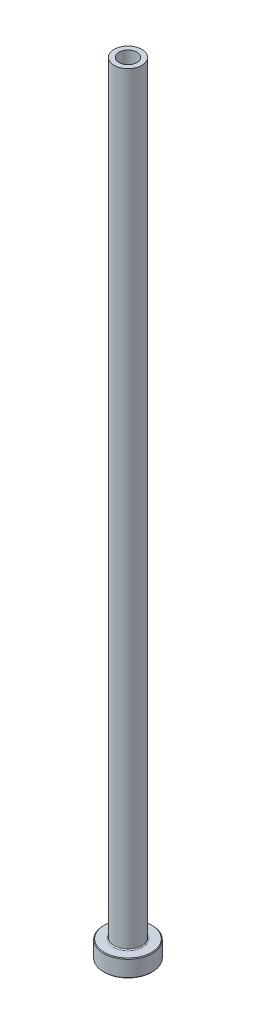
ISO-10303-21;
HEADER;
FILE_DESCRIPTION(('STEP AP214'),'2;1');
FILE_NAME('part.step','',(''),(''),'','','');
FILE_SCHEMA(('AUTOMOTIVE_DESIGN { 1 0 10303 214 1 1 1 1 }'));
ENDSEC;
DATA;
#1=APPLICATION_CONTEXT('core data for automotive mechanical design processes');
#2=APPLICATION_PROTOCOL_DEFINITION('international standard','automotive_design',2000,#1);
#3=PRODUCT_CONTEXT('',#1,'mechanical');
#4=PRODUCT('Part','Part','',(#3));
#5=PRODUCT_RELATED_PRODUCT_CATEGORY('part','',(#4));
#6=PRODUCT_DEFINITION_FORMATION('','',#4);
#7=PRODUCT_DEFINITION_CONTEXT('part definition',#1,'design');
#8=PRODUCT_DEFINITION('design','',#6,#7);
#9=PRODUCT_DEFINITION_SHAPE('','',#8);
#10=(LENGTH_UNIT() NAMED_UNIT(*) SI_UNIT(.MILLI.,.METRE.));
#11=(NAMED_UNIT(*) PLANE_ANGLE_UNIT() SI_UNIT($,.RADIAN.));
#12=(NAMED_UNIT(*) SI_UNIT($,.STERADIAN.) SOLID_ANGLE_UNIT());
#13=UNCERTAINTY_MEASURE_WITH_UNIT(LENGTH_MEASURE(1.E-05),#10,'distance_accuracy_value','');
#14=(GEOMETRIC_REPRESENTATION_CONTEXT(3) GLOBAL_UNCERTAINTY_ASSIGNED_CONTEXT((#13)) GLOBAL_UNIT_ASSIGNED_CONTEXT((#10,
#11,#12)) REPRESENTATION_CONTEXT('',''));
#15=CARTESIAN_POINT('',(0.,0.,0.));
#16=DIRECTION('',(0.,0.,1.));
#17=DIRECTION('',(1.,0.,0.));
#18=AXIS2_PLACEMENT_3D('',#15,#16,#17);
#19=CARTESIAN_POINT('',(0.,92.1876809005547,0.));
#20=DIRECTION('',(0.,1.,0.));
#21=DIRECTION('',(0.,0.,1.));
#22=AXIS2_PLACEMENT_3D('',#19,#20,#21);
#23=CYLINDRICAL_SURFACE('',#22,2.60000000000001);
#24=CARTESIAN_POINT('',(0.,225.,0.));
#25=DIRECTION('',(0.,1.,0.));
#26=DIRECTION('',(0.,0.,1.));
#27=AXIS2_PLACEMENT_3D('',#24,#25,#26);
#28=CIRCLE('',#27,2.60000000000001);
#29=CARTESIAN_POINT('',(0.,225.,2.60000000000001));
#30=VERTEX_POINT('',#29);
#31=EDGE_CURVE('E62',#30,#30,#28,.T.);
#32=ORIENTED_EDGE('',*,*,#31,.T.);
#33=EDGE_LOOP('',(#32));
#34=FACE_BOUND('',#33,.T.);
#35=CARTESIAN_POINT('',(0.,180.,0.));
#36=DIRECTION('',(0.,1.,0.));
#37=DIRECTION('',(0.,0.,1.));
#38=AXIS2_PLACEMENT_3D('',#35,#36,#37);
#39=CIRCLE('',#38,2.60000000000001);
#40=CARTESIAN_POINT('',(0.,180.,2.60000000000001));
#41=VERTEX_POINT('',#40);
#42=EDGE_CURVE('E71',#41,#41,#39,.T.);
#43=ORIENTED_EDGE('',*,*,#42,.F.);
#44=EDGE_LOOP('',(#43));
#45=FACE_BOUND('',#44,.T.);
#46=ADVANCED_FACE('F30',(#34,#45),#23,.F.);
#47=CARTESIAN_POINT('',(-2.60000000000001,225.,0.));
#48=DIRECTION('',(0.,1.,0.));
#49=DIRECTION('',(0.,0.,1.));
#50=AXIS2_PLACEMENT_3D('',#47,#48,#49);
#51=PLANE('',#50);
#52=CARTESIAN_POINT('',(0.,225.,0.));
#53=DIRECTION('',(0.,1.,0.));
#54=DIRECTION('',(0.,0.,1.));
#55=AXIS2_PLACEMENT_3D('',#52,#53,#54);
#56=CIRCLE('',#55,4.00000000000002);
#57=CARTESIAN_POINT('',(0.,225.,4.00000000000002));
#58=VERTEX_POINT('',#57);
#59=EDGE_CURVE('E65',#58,#58,#56,.T.);
#60=ORIENTED_EDGE('',*,*,#59,.T.);
#61=EDGE_LOOP('',(#60));
#62=FACE_BOUND('',#61,.T.);
#63=ORIENTED_EDGE('',*,*,#31,.F.);
#64=EDGE_LOOP('',(#63));
#65=FACE_BOUND('',#64,.T.);
#66=ADVANCED_FACE('F79',(#62,#65),#51,.T.);
#67=CARTESIAN_POINT('',(0.,92.1876809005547,0.));
#68=DIRECTION('',(0.,1.,0.));
#69=DIRECTION('',(0.,0.,1.));
#70=AXIS2_PLACEMENT_3D('',#67,#68,#69);
#71=CYLINDRICAL_SURFACE('',#70,4.);
#72=CARTESIAN_POINT('',(0.,5.3,0.));
#73=DIRECTION('',(0.,1.,0.));
#74=DIRECTION('',(0.,0.,1.));
#75=AXIS2_PLACEMENT_3D('',#72,#73,#74);
#76=CIRCLE('',#75,4.);
#77=CARTESIAN_POINT('',(0.,5.3,4.));
#78=VERTEX_POINT('',#77);
#79=EDGE_CURVE('E59',#78,#78,#76,.T.);
#80=ORIENTED_EDGE('',*,*,#79,.T.);
#81=EDGE_LOOP('',(#80));
#82=FACE_BOUND('',#81,.T.);
#83=ORIENTED_EDGE('',*,*,#59,.F.);
#84=EDGE_LOOP('',(#83));
#85=FACE_BOUND('',#84,.T.);
#86=ADVANCED_FACE('F85',(#82,#85),#71,.T.);
#87=CARTESIAN_POINT('',(-3.99999999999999,5.,0.));
#88=DIRECTION('',(0.,1.,0.));
#89=DIRECTION('',(0.,0.,1.));
#90=AXIS2_PLACEMENT_3D('',#87,#88,#89);
#91=PLANE('',#90);
#92=CARTESIAN_POINT('',(0.,5.,0.));
#93=DIRECTION('',(0.,1.,0.));
#94=DIRECTION('',(0.,0.,1.));
#95=AXIS2_PLACEMENT_3D('',#92,#93,#94);
#96=CIRCLE('',#95,6.79999999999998);
#97=CARTESIAN_POINT('',(0.,5.,6.79999999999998));
#98=VERTEX_POINT('',#97);
#99=EDGE_CURVE('E53',#98,#98,#96,.T.);
#100=ORIENTED_EDGE('',*,*,#99,.T.);
#101=EDGE_LOOP('',(#100));
#102=FACE_BOUND('',#101,.T.);
#103=CARTESIAN_POINT('',(0.,5.,0.));
#104=DIRECTION('',(0.,1.,0.));
#105=DIRECTION('',(0.,0.,1.));
#106=AXIS2_PLACEMENT_3D('',#103,#104,#105);
#107=CIRCLE('',#106,4.3);
#108=CARTESIAN_POINT('',(0.,5.,4.3));
#109=VERTEX_POINT('',#108);
#110=EDGE_CURVE('E56',#109,#109,#107,.F.);
#111=ORIENTED_EDGE('',*,*,#110,.T.);
#112=EDGE_LOOP('',(#111));
#113=FACE_BOUND('',#112,.T.);
#114=ADVANCED_FACE('F111',(#102,#113),#91,.T.);
#115=CARTESIAN_POINT('',(0.,92.1876809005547,0.));
#116=DIRECTION('',(0.,1.,0.));
#117=DIRECTION('',(0.,0.,1.));
#118=AXIS2_PLACEMENT_3D('',#115,#116,#117);
#119=CYLINDRICAL_SURFACE('',#118,6.99999999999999);
#120=CARTESIAN_POINT('',(0.,4.79999999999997,0.));
#121=DIRECTION('',(0.,1.,0.));
#122=DIRECTION('',(0.,0.,1.));
#123=AXIS2_PLACEMENT_3D('',#120,#121,#122);
#124=CIRCLE('',#123,6.99999999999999);
#125=CARTESIAN_POINT('',(0.,4.79999999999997,6.99999999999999));
#126=VERTEX_POINT('',#125);
#127=EDGE_CURVE('E45',#126,#126,#124,.F.);
#128=ORIENTED_EDGE('',*,*,#127,.T.);
#129=EDGE_LOOP('',(#128));
#130=FACE_BOUND('',#129,.T.);
#131=CARTESIAN_POINT('',(0.,0.20000000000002,0.));
#132=DIRECTION('',(0.,-1.,0.));
#133=DIRECTION('',(0.,0.,-1.));
#134=AXIS2_PLACEMENT_3D('',#131,#132,#133);
#135=CIRCLE('',#134,6.99999999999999);
#136=CARTESIAN_POINT('',(0.,0.20000000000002,-6.99999999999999));
#137=VERTEX_POINT('',#136);
#138=EDGE_CURVE('E50',#137,#137,#135,.F.);
#139=ORIENTED_EDGE('',*,*,#138,.T.);
#140=EDGE_LOOP('',(#139));
#141=FACE_BOUND('',#140,.T.);
#142=ADVANCED_FACE('F108',(#130,#141),#119,.T.);
#143=CARTESIAN_POINT('',(-6.99999999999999,0.,0.));
#144=DIRECTION('',(0.,-1.,0.));
#145=DIRECTION('',(0.,0.,-1.));
#146=AXIS2_PLACEMENT_3D('',#143,#144,#145);
#147=PLANE('',#146);
#148=CARTESIAN_POINT('',(0.,0.,0.));
#149=DIRECTION('',(0.,-1.,0.));
#150=DIRECTION('',(0.,0.,-1.));
#151=AXIS2_PLACEMENT_3D('',#148,#149,#150);
#152=CIRCLE('',#151,3.34999999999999);
#153=CARTESIAN_POINT('',(0.,0.,-3.34999999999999));
#154=VERTEX_POINT('',#153);
#155=EDGE_CURVE('E37',#154,#154,#152,.F.);
#156=ORIENTED_EDGE('',*,*,#155,.T.);
#157=EDGE_LOOP('',(#156));
#158=FACE_BOUND('',#157,.T.);
#159=CARTESIAN_POINT('',(0.,0.,0.));
#160=DIRECTION('',(0.,-1.,0.));
#161=DIRECTION('',(0.,0.,-1.));
#162=AXIS2_PLACEMENT_3D('',#159,#160,#161);
#163=CIRCLE('',#162,6.79999999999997);
#164=CARTESIAN_POINT('',(0.,0.,-6.79999999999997));
#165=VERTEX_POINT('',#164);
#166=EDGE_CURVE('E41',#165,#165,#163,.T.);
#167=ORIENTED_EDGE('',*,*,#166,.T.);
#168=EDGE_LOOP('',(#167));
#169=FACE_BOUND('',#168,.T.);
#170=ADVANCED_FACE('F110',(#158,#169),#147,.T.);
#171=CARTESIAN_POINT('',(0.,92.1876809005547,0.));
#172=DIRECTION('',(0.,1.,0.));
#173=DIRECTION('',(0.,0.,1.));
#174=AXIS2_PLACEMENT_3D('',#171,#172,#173);
#175=CYLINDRICAL_SURFACE('',#174,2.85);
#176=CARTESIAN_POINT('',(0.,0.499999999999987,0.));
#177=DIRECTION('',(0.,-1.,0.));
#178=DIRECTION('',(0.,0.,-1.));
#179=AXIS2_PLACEMENT_3D('',#176,#177,#178);
#180=CIRCLE('',#179,2.85);
#181=CARTESIAN_POINT('',(0.,0.499999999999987,-2.85));
#182=VERTEX_POINT('',#181);
#183=EDGE_CURVE('E10',#182,#182,#180,.T.);
#184=ORIENTED_EDGE('',*,*,#183,.T.);
#185=EDGE_LOOP('',(#184));
#186=FACE_BOUND('',#185,.T.);
#187=CARTESIAN_POINT('',(0.,168.,0.));
#188=DIRECTION('',(0.,1.,0.));
#189=DIRECTION('',(0.,0.,1.));
#190=AXIS2_PLACEMENT_3D('',#187,#188,#189);
#191=CIRCLE('',#190,2.85000000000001);
#192=CARTESIAN_POINT('',(0.,168.,2.85000000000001));
#193=VERTEX_POINT('',#192);
#194=EDGE_CURVE('E68',#193,#193,#191,.T.);
#195=ORIENTED_EDGE('',*,*,#194,.T.);
#196=EDGE_LOOP('',(#195));
#197=FACE_BOUND('',#196,.T.);
#198=ADVANCED_FACE('F118',(#186,#197),#175,.F.);
#199=CARTESIAN_POINT('',(0.,168.,0.));
#200=DIRECTION('',(0.,-1.,0.));
#201=DIRECTION('',(0.,0.,-1.));
#202=AXIS2_PLACEMENT_3D('',#199,#200,#201);
#203=CONICAL_SURFACE('',#202,2.85000000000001,0.0208303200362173);
#204=ORIENTED_EDGE('',*,*,#42,.T.);
#205=EDGE_LOOP('',(#204));
#206=FACE_BOUND('',#205,.T.);
#207=ORIENTED_EDGE('',*,*,#194,.F.);
#208=EDGE_LOOP('',(#207));
#209=FACE_BOUND('',#208,.T.);
#210=ADVANCED_FACE('F75',(#206,#209),#203,.F.);
#211=CARTESIAN_POINT('',(0.,5.3,0.));
#212=DIRECTION('',(0.,1.,0.));
#213=DIRECTION('',(0.,0.,1.));
#214=AXIS2_PLACEMENT_3D('',#211,#212,#213);
#215=TOROIDAL_SURFACE('',#214,4.3,0.3);
#216=ORIENTED_EDGE('',*,*,#110,.F.);
#217=EDGE_LOOP('',(#216));
#218=FACE_BOUND('',#217,.T.);
#219=ORIENTED_EDGE('',*,*,#79,.F.);
#220=EDGE_LOOP('',(#219));
#221=FACE_BOUND('',#220,.T.);
#222=ADVANCED_FACE('F90',(#218,#221),#215,.F.);
#223=CARTESIAN_POINT('',(0.,5.,0.));
#224=DIRECTION('',(0.,-1.,0.));
#225=DIRECTION('',(0.,0.,-1.));
#226=AXIS2_PLACEMENT_3D('',#223,#224,#225);
#227=CONICAL_SURFACE('',#226,6.79999999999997,0.785398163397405);
#228=ORIENTED_EDGE('',*,*,#127,.F.);
#229=EDGE_LOOP('',(#228));
#230=FACE_BOUND('',#229,.T.);
#231=ORIENTED_EDGE('',*,*,#99,.F.);
#232=EDGE_LOOP('',(#231));
#233=FACE_BOUND('',#232,.T.);
#234=ADVANCED_FACE('F93',(#230,#233),#227,.T.);
#235=CARTESIAN_POINT('',(0.,0.20000000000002,0.));
#236=DIRECTION('',(0.,1.,0.));
#237=DIRECTION('',(0.,0.,1.));
#238=AXIS2_PLACEMENT_3D('',#235,#236,#237);
#239=CONICAL_SURFACE('',#238,6.99999999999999,0.78539816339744);
#240=ORIENTED_EDGE('',*,*,#166,.F.);
#241=EDGE_LOOP('',(#240));
#242=FACE_BOUND('',#241,.T.);
#243=ORIENTED_EDGE('',*,*,#138,.F.);
#244=EDGE_LOOP('',(#243));
#245=FACE_BOUND('',#244,.T.);
#246=ADVANCED_FACE('F96',(#242,#245),#239,.T.);
#247=CARTESIAN_POINT('',(0.,0.,0.));
#248=DIRECTION('',(0.,-1.,0.));
#249=DIRECTION('',(0.,0.,-1.));
#250=AXIS2_PLACEMENT_3D('',#247,#248,#249);
#251=CONICAL_SURFACE('',#250,3.34999999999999,0.785398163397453);
#252=ORIENTED_EDGE('',*,*,#183,.F.);
#253=EDGE_LOOP('',(#252));
#254=FACE_BOUND('',#253,.T.);
#255=ORIENTED_EDGE('',*,*,#155,.F.);
#256=EDGE_LOOP('',(#255));
#257=FACE_BOUND('',#256,.T.);
#258=ADVANCED_FACE('F32',(#254,#257),#251,.F.);
#259=CLOSED_SHELL('',(#46,#66,#86,#114,#142,#170,#198,#210,#222,#234,#246,#258));
#260=MANIFOLD_SOLID_BREP('B2',#259);
#261=ADVANCED_BREP_SHAPE_REPRESENTATION('',(#18,#260),#14);
#262=SHAPE_DEFINITION_REPRESENTATION(#9,#261);
ENDSEC;
END-ISO-10303-21;
